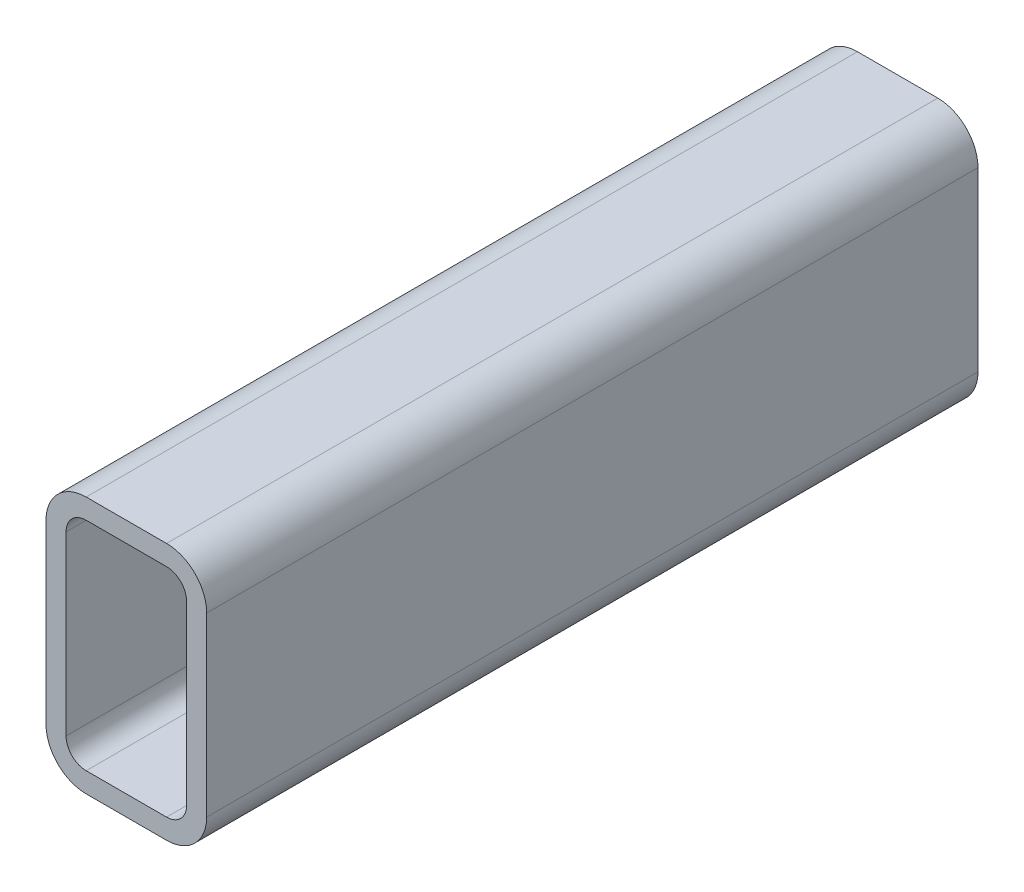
ISO-10303-21;
HEADER;
FILE_DESCRIPTION(('STEP AP214'),'2;1');
FILE_NAME('part.step','',(''),(''),'','','');
FILE_SCHEMA(('AUTOMOTIVE_DESIGN { 1 0 10303 214 1 1 1 1 }'));
ENDSEC;
DATA;
#1=APPLICATION_CONTEXT('core data for automotive mechanical design processes');
#2=APPLICATION_PROTOCOL_DEFINITION('international standard','automotive_design',2000,#1);
#3=PRODUCT_CONTEXT('',#1,'mechanical');
#4=PRODUCT('Part','Part','',(#3));
#5=PRODUCT_RELATED_PRODUCT_CATEGORY('part','',(#4));
#6=PRODUCT_DEFINITION_FORMATION('','',#4);
#7=PRODUCT_DEFINITION_CONTEXT('part definition',#1,'design');
#8=PRODUCT_DEFINITION('design','',#6,#7);
#9=PRODUCT_DEFINITION_SHAPE('','',#8);
#10=(LENGTH_UNIT() NAMED_UNIT(*) SI_UNIT(.MILLI.,.METRE.));
#11=(NAMED_UNIT(*) PLANE_ANGLE_UNIT() SI_UNIT($,.RADIAN.));
#12=(NAMED_UNIT(*) SI_UNIT($,.STERADIAN.) SOLID_ANGLE_UNIT());
#13=UNCERTAINTY_MEASURE_WITH_UNIT(LENGTH_MEASURE(1.E-05),#10,'distance_accuracy_value','');
#14=(GEOMETRIC_REPRESENTATION_CONTEXT(3) GLOBAL_UNCERTAINTY_ASSIGNED_CONTEXT((#13)) GLOBAL_UNIT_ASSIGNED_CONTEXT((#10,
#11,#12)) REPRESENTATION_CONTEXT('',''));
#15=CARTESIAN_POINT('',(0.,0.,0.));
#16=DIRECTION('',(0.,0.,1.));
#17=DIRECTION('',(1.,0.,0.));
#18=AXIS2_PLACEMENT_3D('',#15,#16,#17);
#19=CARTESIAN_POINT('',(18.7710851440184,87.7827651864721,304.8));
#20=DIRECTION('',(0.,0.,1.));
#21=DIRECTION('',(1.,0.,0.));
#22=AXIS2_PLACEMENT_3D('',#19,#20,#21);
#23=PLANE('',#22);
#24=CARTESIAN_POINT('',(18.7710851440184,87.7827651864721,304.8));
#25=DIRECTION('',(0.,0.,1.));
#26=DIRECTION('',(1.,0.,0.));
#27=AXIS2_PLACEMENT_3D('',#24,#25,#26);
#28=CIRCLE('',#27,15.875);
#29=CARTESIAN_POINT('',(18.7710851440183,103.657765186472,304.8));
#30=VERTEX_POINT('',#29);
#31=CARTESIAN_POINT('',(2.89608514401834,87.7827651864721,304.8));
#32=VERTEX_POINT('',#31);
#33=EDGE_CURVE('E211',#30,#32,#28,.T.);
#34=ORIENTED_EDGE('',*,*,#33,.T.);
#35=DIRECTION('',(0.,-1.,0.));
#36=VECTOR('',#35,1.);
#37=CARTESIAN_POINT('',(2.89608514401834,17.9327651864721,304.8));
#38=LINE('',#37,#36);
#39=CARTESIAN_POINT('',(2.89608514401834,17.9327651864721,304.8));
#40=VERTEX_POINT('',#39);
#41=EDGE_CURVE('E214',#32,#40,#38,.T.);
#42=ORIENTED_EDGE('',*,*,#41,.T.);
#43=CARTESIAN_POINT('',(18.7710851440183,17.9327651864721,304.8));
#44=DIRECTION('',(0.,0.,1.));
#45=DIRECTION('',(1.,0.,0.));
#46=AXIS2_PLACEMENT_3D('',#43,#44,#45);
#47=CIRCLE('',#46,15.875);
#48=CARTESIAN_POINT('',(18.7710851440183,2.05776518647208,304.8));
#49=VERTEX_POINT('',#48);
#50=EDGE_CURVE('E217',#40,#49,#47,.T.);
#51=ORIENTED_EDGE('',*,*,#50,.T.);
#52=DIRECTION('',(1.,0.,0.));
#53=VECTOR('',#52,1.);
#54=CARTESIAN_POINT('',(50.5210851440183,2.05776518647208,304.8));
#55=LINE('',#54,#53);
#56=CARTESIAN_POINT('',(50.5210851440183,2.05776518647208,304.8));
#57=VERTEX_POINT('',#56);
#58=EDGE_CURVE('E219',#49,#57,#55,.T.);
#59=ORIENTED_EDGE('',*,*,#58,.T.);
#60=CARTESIAN_POINT('',(50.5210851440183,17.9327651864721,304.8));
#61=DIRECTION('',(0.,0.,1.));
#62=DIRECTION('',(1.,0.,0.));
#63=AXIS2_PLACEMENT_3D('',#60,#61,#62);
#64=CIRCLE('',#63,15.875);
#65=CARTESIAN_POINT('',(66.3960851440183,17.9327651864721,304.8));
#66=VERTEX_POINT('',#65);
#67=EDGE_CURVE('E221',#57,#66,#64,.T.);
#68=ORIENTED_EDGE('',*,*,#67,.T.);
#69=DIRECTION('',(0.,1.,0.));
#70=VECTOR('',#69,1.);
#71=CARTESIAN_POINT('',(66.3960851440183,87.7827651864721,304.8));
#72=LINE('',#71,#70);
#73=CARTESIAN_POINT('',(66.3960851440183,87.7827651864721,304.8));
#74=VERTEX_POINT('',#73);
#75=EDGE_CURVE('E223',#66,#74,#72,.T.);
#76=ORIENTED_EDGE('',*,*,#75,.T.);
#77=CARTESIAN_POINT('',(50.5210851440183,87.7827651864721,304.8));
#78=DIRECTION('',(0.,0.,1.));
#79=DIRECTION('',(1.,0.,0.));
#80=AXIS2_PLACEMENT_3D('',#77,#78,#79);
#81=CIRCLE('',#80,15.875);
#82=CARTESIAN_POINT('',(50.5210851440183,103.657765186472,304.8));
#83=VERTEX_POINT('',#82);
#84=EDGE_CURVE('E225',#74,#83,#81,.T.);
#85=ORIENTED_EDGE('',*,*,#84,.T.);
#86=DIRECTION('',(-1.,0.,0.));
#87=VECTOR('',#86,1.);
#88=CARTESIAN_POINT('',(18.7710851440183,103.657765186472,304.8));
#89=LINE('',#88,#87);
#90=EDGE_CURVE('E227',#83,#30,#89,.T.);
#91=ORIENTED_EDGE('',*,*,#90,.T.);
#92=EDGE_LOOP('',(#34,#42,#51,#59,#68,#76,#85,#91));
#93=FACE_BOUND('',#92,.T.);
#94=DIRECTION('',(0.,-1.,0.));
#95=VECTOR('',#94,1.);
#96=CARTESIAN_POINT('',(10.8335851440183,17.9327651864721,304.8));
#97=LINE('',#96,#95);
#98=CARTESIAN_POINT('',(10.8335851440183,87.7827651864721,304.8));
#99=VERTEX_POINT('',#98);
#100=CARTESIAN_POINT('',(10.8335851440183,17.9327651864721,304.8));
#101=VERTEX_POINT('',#100);
#102=EDGE_CURVE('E154',#99,#101,#97,.T.);
#103=ORIENTED_EDGE('',*,*,#102,.F.);
#104=CARTESIAN_POINT('',(18.7710851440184,87.7827651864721,304.8));
#105=DIRECTION('',(0.,0.,1.));
#106=DIRECTION('',(1.,0.,0.));
#107=AXIS2_PLACEMENT_3D('',#104,#105,#106);
#108=CIRCLE('',#107,7.9375);
#109=CARTESIAN_POINT('',(18.7710851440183,95.7202651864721,304.8));
#110=VERTEX_POINT('',#109);
#111=EDGE_CURVE('E146',#110,#99,#108,.T.);
#112=ORIENTED_EDGE('',*,*,#111,.F.);
#113=DIRECTION('',(-1.,0.,0.));
#114=VECTOR('',#113,1.);
#115=CARTESIAN_POINT('',(18.7710851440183,95.7202651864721,304.8));
#116=LINE('',#115,#114);
#117=CARTESIAN_POINT('',(50.5210851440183,95.7202651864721,304.8));
#118=VERTEX_POINT('',#117);
#119=EDGE_CURVE('E179',#118,#110,#116,.T.);
#120=ORIENTED_EDGE('',*,*,#119,.F.);
#121=CARTESIAN_POINT('',(50.5210851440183,87.7827651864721,304.8));
#122=DIRECTION('',(0.,0.,1.));
#123=DIRECTION('',(1.,0.,0.));
#124=AXIS2_PLACEMENT_3D('',#121,#122,#123);
#125=CIRCLE('',#124,7.93750000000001);
#126=CARTESIAN_POINT('',(58.4585851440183,87.7827651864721,304.8));
#127=VERTEX_POINT('',#126);
#128=EDGE_CURVE('E177',#127,#118,#125,.T.);
#129=ORIENTED_EDGE('',*,*,#128,.F.);
#130=DIRECTION('',(0.,1.,0.));
#131=VECTOR('',#130,1.);
#132=CARTESIAN_POINT('',(58.4585851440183,87.7827651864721,304.8));
#133=LINE('',#132,#131);
#134=CARTESIAN_POINT('',(58.4585851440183,17.9327651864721,304.8));
#135=VERTEX_POINT('',#134);
#136=EDGE_CURVE('E175',#135,#127,#133,.T.);
#137=ORIENTED_EDGE('',*,*,#136,.F.);
#138=CARTESIAN_POINT('',(50.5210851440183,17.9327651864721,304.8));
#139=DIRECTION('',(0.,0.,1.));
#140=DIRECTION('',(1.,0.,0.));
#141=AXIS2_PLACEMENT_3D('',#138,#139,#140);
#142=CIRCLE('',#141,7.93750000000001);
#143=CARTESIAN_POINT('',(50.5210851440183,9.99526518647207,304.8));
#144=VERTEX_POINT('',#143);
#145=EDGE_CURVE('E173',#144,#135,#142,.T.);
#146=ORIENTED_EDGE('',*,*,#145,.F.);
#147=DIRECTION('',(1.,0.,0.));
#148=VECTOR('',#147,1.);
#149=CARTESIAN_POINT('',(50.5210851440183,9.99526518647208,304.8));
#150=LINE('',#149,#148);
#151=CARTESIAN_POINT('',(18.7710851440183,9.99526518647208,304.8));
#152=VERTEX_POINT('',#151);
#153=EDGE_CURVE('E169',#152,#144,#150,.T.);
#154=ORIENTED_EDGE('',*,*,#153,.F.);
#155=CARTESIAN_POINT('',(18.7710851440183,17.9327651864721,304.8));
#156=DIRECTION('',(0.,0.,1.));
#157=DIRECTION('',(1.,0.,0.));
#158=AXIS2_PLACEMENT_3D('',#155,#156,#157);
#159=CIRCLE('',#158,7.9375);
#160=EDGE_CURVE('E167',#101,#152,#159,.T.);
#161=ORIENTED_EDGE('',*,*,#160,.F.);
#162=EDGE_LOOP('',(#103,#112,#120,#129,#137,#146,#154,#161));
#163=FACE_BOUND('',#162,.T.);
#164=ADVANCED_FACE('F33',(#93,#163),#23,.T.);
#165=CARTESIAN_POINT('',(18.7710851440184,87.7827651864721,0.));
#166=DIRECTION('',(0.,0.,1.));
#167=DIRECTION('',(1.,0.,0.));
#168=AXIS2_PLACEMENT_3D('',#165,#166,#167);
#169=PLANE('',#168);
#170=CARTESIAN_POINT('',(18.7710851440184,87.7827651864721,0.));
#171=DIRECTION('',(0.,0.,1.));
#172=DIRECTION('',(1.,0.,0.));
#173=AXIS2_PLACEMENT_3D('',#170,#171,#172);
#174=CIRCLE('',#173,15.875);
#175=CARTESIAN_POINT('',(18.7710851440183,103.657765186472,0.));
#176=VERTEX_POINT('',#175);
#177=CARTESIAN_POINT('',(2.89608514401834,87.7827651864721,0.));
#178=VERTEX_POINT('',#177);
#179=EDGE_CURVE('E162',#176,#178,#174,.T.);
#180=ORIENTED_EDGE('',*,*,#179,.F.);
#181=DIRECTION('',(-1.,0.,0.));
#182=VECTOR('',#181,1.);
#183=CARTESIAN_POINT('',(18.7710851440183,103.657765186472,0.));
#184=LINE('',#183,#182);
#185=CARTESIAN_POINT('',(50.5210851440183,103.657765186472,0.));
#186=VERTEX_POINT('',#185);
#187=EDGE_CURVE('E215',#186,#176,#184,.T.);
#188=ORIENTED_EDGE('',*,*,#187,.F.);
#189=CARTESIAN_POINT('',(50.5210851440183,87.7827651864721,0.));
#190=DIRECTION('',(0.,0.,1.));
#191=DIRECTION('',(1.,0.,0.));
#192=AXIS2_PLACEMENT_3D('',#189,#190,#191);
#193=CIRCLE('',#192,15.875);
#194=CARTESIAN_POINT('',(66.3960851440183,87.7827651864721,0.));
#195=VERTEX_POINT('',#194);
#196=EDGE_CURVE('E242',#195,#186,#193,.T.);
#197=ORIENTED_EDGE('',*,*,#196,.F.);
#198=DIRECTION('',(0.,1.,0.));
#199=VECTOR('',#198,1.);
#200=CARTESIAN_POINT('',(66.3960851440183,87.7827651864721,0.));
#201=LINE('',#200,#199);
#202=CARTESIAN_POINT('',(66.3960851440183,17.9327651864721,0.));
#203=VERTEX_POINT('',#202);
#204=EDGE_CURVE('E240',#203,#195,#201,.T.);
#205=ORIENTED_EDGE('',*,*,#204,.F.);
#206=CARTESIAN_POINT('',(50.5210851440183,17.9327651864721,0.));
#207=DIRECTION('',(0.,0.,1.));
#208=DIRECTION('',(1.,0.,0.));
#209=AXIS2_PLACEMENT_3D('',#206,#207,#208);
#210=CIRCLE('',#209,15.875);
#211=CARTESIAN_POINT('',(50.5210851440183,2.05776518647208,0.));
#212=VERTEX_POINT('',#211);
#213=EDGE_CURVE('E238',#212,#203,#210,.T.);
#214=ORIENTED_EDGE('',*,*,#213,.F.);
#215=DIRECTION('',(1.,0.,0.));
#216=VECTOR('',#215,1.);
#217=CARTESIAN_POINT('',(50.5210851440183,2.05776518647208,0.));
#218=LINE('',#217,#216);
#219=CARTESIAN_POINT('',(18.7710851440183,2.05776518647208,0.));
#220=VERTEX_POINT('',#219);
#221=EDGE_CURVE('E236',#220,#212,#218,.T.);
#222=ORIENTED_EDGE('',*,*,#221,.F.);
#223=CARTESIAN_POINT('',(18.7710851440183,17.9327651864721,0.));
#224=DIRECTION('',(0.,0.,1.));
#225=DIRECTION('',(1.,0.,0.));
#226=AXIS2_PLACEMENT_3D('',#223,#224,#225);
#227=CIRCLE('',#226,15.875);
#228=CARTESIAN_POINT('',(2.89608514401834,17.9327651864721,0.));
#229=VERTEX_POINT('',#228);
#230=EDGE_CURVE('E234',#229,#220,#227,.T.);
#231=ORIENTED_EDGE('',*,*,#230,.F.);
#232=DIRECTION('',(0.,-1.,0.));
#233=VECTOR('',#232,1.);
#234=CARTESIAN_POINT('',(2.89608514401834,17.9327651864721,0.));
#235=LINE('',#234,#233);
#236=EDGE_CURVE('E232',#178,#229,#235,.T.);
#237=ORIENTED_EDGE('',*,*,#236,.F.);
#238=EDGE_LOOP('',(#180,#188,#197,#205,#214,#222,#231,#237));
#239=FACE_BOUND('',#238,.T.);
#240=CARTESIAN_POINT('',(18.7710851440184,87.7827651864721,0.));
#241=DIRECTION('',(0.,0.,1.));
#242=DIRECTION('',(1.,0.,0.));
#243=AXIS2_PLACEMENT_3D('',#240,#241,#242);
#244=CIRCLE('',#243,7.9375);
#245=CARTESIAN_POINT('',(18.7710851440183,95.7202651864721,0.));
#246=VERTEX_POINT('',#245);
#247=CARTESIAN_POINT('',(10.8335851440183,87.7827651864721,0.));
#248=VERTEX_POINT('',#247);
#249=EDGE_CURVE('E56',#246,#248,#244,.T.);
#250=ORIENTED_EDGE('',*,*,#249,.T.);
#251=DIRECTION('',(0.,-1.,0.));
#252=VECTOR('',#251,1.);
#253=CARTESIAN_POINT('',(10.8335851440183,17.9327651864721,0.));
#254=LINE('',#253,#252);
#255=CARTESIAN_POINT('',(10.8335851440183,17.9327651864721,0.));
#256=VERTEX_POINT('',#255);
#257=EDGE_CURVE('E161',#248,#256,#254,.T.);
#258=ORIENTED_EDGE('',*,*,#257,.T.);
#259=CARTESIAN_POINT('',(18.7710851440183,17.9327651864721,0.));
#260=DIRECTION('',(0.,0.,1.));
#261=DIRECTION('',(1.,0.,0.));
#262=AXIS2_PLACEMENT_3D('',#259,#260,#261);
#263=CIRCLE('',#262,7.9375);
#264=CARTESIAN_POINT('',(18.7710851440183,9.99526518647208,0.));
#265=VERTEX_POINT('',#264);
#266=EDGE_CURVE('E183',#256,#265,#263,.T.);
#267=ORIENTED_EDGE('',*,*,#266,.T.);
#268=DIRECTION('',(1.,0.,0.));
#269=VECTOR('',#268,1.);
#270=CARTESIAN_POINT('',(50.5210851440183,9.99526518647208,0.));
#271=LINE('',#270,#269);
#272=CARTESIAN_POINT('',(50.5210851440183,9.99526518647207,0.));
#273=VERTEX_POINT('',#272);
#274=EDGE_CURVE('E186',#265,#273,#271,.T.);
#275=ORIENTED_EDGE('',*,*,#274,.T.);
#276=CARTESIAN_POINT('',(50.5210851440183,17.9327651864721,0.));
#277=DIRECTION('',(0.,0.,1.));
#278=DIRECTION('',(1.,0.,0.));
#279=AXIS2_PLACEMENT_3D('',#276,#277,#278);
#280=CIRCLE('',#279,7.93750000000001);
#281=CARTESIAN_POINT('',(58.4585851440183,17.9327651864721,0.));
#282=VERTEX_POINT('',#281);
#283=EDGE_CURVE('E189',#273,#282,#280,.T.);
#284=ORIENTED_EDGE('',*,*,#283,.T.);
#285=DIRECTION('',(0.,1.,0.));
#286=VECTOR('',#285,1.);
#287=CARTESIAN_POINT('',(58.4585851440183,87.7827651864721,0.));
#288=LINE('',#287,#286);
#289=CARTESIAN_POINT('',(58.4585851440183,87.7827651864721,0.));
#290=VERTEX_POINT('',#289);
#291=EDGE_CURVE('E192',#282,#290,#288,.T.);
#292=ORIENTED_EDGE('',*,*,#291,.T.);
#293=CARTESIAN_POINT('',(50.5210851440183,87.7827651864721,0.));
#294=DIRECTION('',(0.,0.,1.));
#295=DIRECTION('',(1.,0.,0.));
#296=AXIS2_PLACEMENT_3D('',#293,#294,#295);
#297=CIRCLE('',#296,7.93750000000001);
#298=CARTESIAN_POINT('',(50.5210851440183,95.7202651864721,0.));
#299=VERTEX_POINT('',#298);
#300=EDGE_CURVE('E195',#290,#299,#297,.T.);
#301=ORIENTED_EDGE('',*,*,#300,.T.);
#302=DIRECTION('',(-1.,0.,0.));
#303=VECTOR('',#302,1.);
#304=CARTESIAN_POINT('',(18.7710851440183,95.7202651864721,0.));
#305=LINE('',#304,#303);
#306=EDGE_CURVE('E155',#299,#246,#305,.T.);
#307=ORIENTED_EDGE('',*,*,#306,.T.);
#308=EDGE_LOOP('',(#250,#258,#267,#275,#284,#292,#301,#307));
#309=FACE_BOUND('',#308,.T.);
#310=ADVANCED_FACE('F272',(#239,#309),#169,.F.);
#311=CARTESIAN_POINT('',(18.7710851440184,87.7827651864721,304.8));
#312=DIRECTION('',(0.,0.,-1.));
#313=DIRECTION('',(-1.,0.,0.));
#314=AXIS2_PLACEMENT_3D('',#311,#312,#313);
#315=CYLINDRICAL_SURFACE('',#314,15.875);
#316=ORIENTED_EDGE('',*,*,#179,.T.);
#317=DIRECTION('',(0.,0.,-1.));
#318=VECTOR('',#317,1.);
#319=CARTESIAN_POINT('',(2.89608514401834,87.7827651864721,304.8));
#320=LINE('',#319,#318);
#321=EDGE_CURVE('E11',#32,#178,#320,.T.);
#322=ORIENTED_EDGE('',*,*,#321,.F.);
#323=ORIENTED_EDGE('',*,*,#33,.F.);
#324=DIRECTION('',(0.,0.,-1.));
#325=VECTOR('',#324,1.);
#326=CARTESIAN_POINT('',(18.7710851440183,103.657765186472,304.8));
#327=LINE('',#326,#325);
#328=EDGE_CURVE('E229',#30,#176,#327,.T.);
#329=ORIENTED_EDGE('',*,*,#328,.T.);
#330=EDGE_LOOP('',(#316,#322,#323,#329));
#331=FACE_BOUND('',#330,.T.);
#332=ADVANCED_FACE('F35',(#331),#315,.T.);
#333=CARTESIAN_POINT('',(2.89608514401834,17.9327651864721,304.8));
#334=DIRECTION('',(1.,0.,0.));
#335=DIRECTION('',(0.,0.,-1.));
#336=AXIS2_PLACEMENT_3D('',#333,#334,#335);
#337=PLANE('',#336);
#338=ORIENTED_EDGE('',*,*,#236,.T.);
#339=DIRECTION('',(0.,0.,-1.));
#340=VECTOR('',#339,1.);
#341=CARTESIAN_POINT('',(2.89608514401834,17.9327651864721,304.8));
#342=LINE('',#341,#340);
#343=EDGE_CURVE('E41',#40,#229,#342,.T.);
#344=ORIENTED_EDGE('',*,*,#343,.F.);
#345=ORIENTED_EDGE('',*,*,#41,.F.);
#346=ORIENTED_EDGE('',*,*,#321,.T.);
#347=EDGE_LOOP('',(#338,#344,#345,#346));
#348=FACE_BOUND('',#347,.T.);
#349=ADVANCED_FACE('F289',(#348),#337,.F.);
#350=CARTESIAN_POINT('',(18.7710851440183,17.9327651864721,304.8));
#351=DIRECTION('',(0.,0.,-1.));
#352=DIRECTION('',(-1.,0.,0.));
#353=AXIS2_PLACEMENT_3D('',#350,#351,#352);
#354=CYLINDRICAL_SURFACE('',#353,15.875);
#355=ORIENTED_EDGE('',*,*,#230,.T.);
#356=DIRECTION('',(0.,0.,-1.));
#357=VECTOR('',#356,1.);
#358=CARTESIAN_POINT('',(18.7710851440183,2.05776518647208,304.8));
#359=LINE('',#358,#357);
#360=EDGE_CURVE('E259',#49,#220,#359,.T.);
#361=ORIENTED_EDGE('',*,*,#360,.F.);
#362=ORIENTED_EDGE('',*,*,#50,.F.);
#363=ORIENTED_EDGE('',*,*,#343,.T.);
#364=EDGE_LOOP('',(#355,#361,#362,#363));
#365=FACE_BOUND('',#364,.T.);
#366=ADVANCED_FACE('F266',(#365),#354,.T.);
#367=CARTESIAN_POINT('',(50.5210851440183,2.05776518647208,304.8));
#368=DIRECTION('',(0.,1.,0.));
#369=DIRECTION('',(0.,0.,1.));
#370=AXIS2_PLACEMENT_3D('',#367,#368,#369);
#371=PLANE('',#370);
#372=ORIENTED_EDGE('',*,*,#221,.T.);
#373=DIRECTION('',(0.,0.,-1.));
#374=VECTOR('',#373,1.);
#375=CARTESIAN_POINT('',(50.5210851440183,2.05776518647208,304.8));
#376=LINE('',#375,#374);
#377=EDGE_CURVE('E256',#57,#212,#376,.T.);
#378=ORIENTED_EDGE('',*,*,#377,.F.);
#379=ORIENTED_EDGE('',*,*,#58,.F.);
#380=ORIENTED_EDGE('',*,*,#360,.T.);
#381=EDGE_LOOP('',(#372,#378,#379,#380));
#382=FACE_BOUND('',#381,.T.);
#383=ADVANCED_FACE('F278',(#382),#371,.F.);
#384=CARTESIAN_POINT('',(50.5210851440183,17.9327651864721,304.8));
#385=DIRECTION('',(0.,0.,-1.));
#386=DIRECTION('',(-1.,0.,0.));
#387=AXIS2_PLACEMENT_3D('',#384,#385,#386);
#388=CYLINDRICAL_SURFACE('',#387,15.875);
#389=ORIENTED_EDGE('',*,*,#213,.T.);
#390=DIRECTION('',(0.,0.,-1.));
#391=VECTOR('',#390,1.);
#392=CARTESIAN_POINT('',(66.3960851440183,17.9327651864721,304.8));
#393=LINE('',#392,#391);
#394=EDGE_CURVE('E253',#66,#203,#393,.T.);
#395=ORIENTED_EDGE('',*,*,#394,.F.);
#396=ORIENTED_EDGE('',*,*,#67,.F.);
#397=ORIENTED_EDGE('',*,*,#377,.T.);
#398=EDGE_LOOP('',(#389,#395,#396,#397));
#399=FACE_BOUND('',#398,.T.);
#400=ADVANCED_FACE('F282',(#399),#388,.T.);
#401=CARTESIAN_POINT('',(66.3960851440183,87.7827651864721,304.8));
#402=DIRECTION('',(-1.,0.,0.));
#403=DIRECTION('',(0.,0.,1.));
#404=AXIS2_PLACEMENT_3D('',#401,#402,#403);
#405=PLANE('',#404);
#406=ORIENTED_EDGE('',*,*,#204,.T.);
#407=DIRECTION('',(0.,0.,-1.));
#408=VECTOR('',#407,1.);
#409=CARTESIAN_POINT('',(66.3960851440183,87.7827651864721,304.8));
#410=LINE('',#409,#408);
#411=EDGE_CURVE('E250',#74,#195,#410,.T.);
#412=ORIENTED_EDGE('',*,*,#411,.F.);
#413=ORIENTED_EDGE('',*,*,#75,.F.);
#414=ORIENTED_EDGE('',*,*,#394,.T.);
#415=EDGE_LOOP('',(#406,#412,#413,#414));
#416=FACE_BOUND('',#415,.T.);
#417=ADVANCED_FACE('F302',(#416),#405,.F.);
#418=CARTESIAN_POINT('',(50.5210851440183,87.7827651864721,304.8));
#419=DIRECTION('',(0.,0.,-1.));
#420=DIRECTION('',(-1.,0.,0.));
#421=AXIS2_PLACEMENT_3D('',#418,#419,#420);
#422=CYLINDRICAL_SURFACE('',#421,15.875);
#423=ORIENTED_EDGE('',*,*,#196,.T.);
#424=DIRECTION('',(0.,0.,-1.));
#425=VECTOR('',#424,1.);
#426=CARTESIAN_POINT('',(50.5210851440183,103.657765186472,304.8));
#427=LINE('',#426,#425);
#428=EDGE_CURVE('E247',#83,#186,#427,.T.);
#429=ORIENTED_EDGE('',*,*,#428,.F.);
#430=ORIENTED_EDGE('',*,*,#84,.F.);
#431=ORIENTED_EDGE('',*,*,#411,.T.);
#432=EDGE_LOOP('',(#423,#429,#430,#431));
#433=FACE_BOUND('',#432,.T.);
#434=ADVANCED_FACE('F300',(#433),#422,.T.);
#435=CARTESIAN_POINT('',(18.7710851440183,103.657765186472,304.8));
#436=DIRECTION('',(0.,-1.,0.));
#437=DIRECTION('',(0.,0.,-1.));
#438=AXIS2_PLACEMENT_3D('',#435,#436,#437);
#439=PLANE('',#438);
#440=ORIENTED_EDGE('',*,*,#187,.T.);
#441=ORIENTED_EDGE('',*,*,#328,.F.);
#442=ORIENTED_EDGE('',*,*,#90,.F.);
#443=ORIENTED_EDGE('',*,*,#428,.T.);
#444=EDGE_LOOP('',(#440,#441,#442,#443));
#445=FACE_BOUND('',#444,.T.);
#446=ADVANCED_FACE('F295',(#445),#439,.F.);
#447=CARTESIAN_POINT('',(18.7710851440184,87.7827651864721,304.8));
#448=DIRECTION('',(0.,0.,-1.));
#449=DIRECTION('',(-1.,0.,0.));
#450=AXIS2_PLACEMENT_3D('',#447,#448,#449);
#451=CYLINDRICAL_SURFACE('',#450,7.9375);
#452=ORIENTED_EDGE('',*,*,#249,.F.);
#453=DIRECTION('',(0.,0.,-1.));
#454=VECTOR('',#453,1.);
#455=CARTESIAN_POINT('',(18.7710851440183,95.7202651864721,304.8));
#456=LINE('',#455,#454);
#457=EDGE_CURVE('E150',#110,#246,#456,.T.);
#458=ORIENTED_EDGE('',*,*,#457,.F.);
#459=ORIENTED_EDGE('',*,*,#111,.T.);
#460=DIRECTION('',(0.,0.,-1.));
#461=VECTOR('',#460,1.);
#462=CARTESIAN_POINT('',(10.8335851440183,87.7827651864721,304.8));
#463=LINE('',#462,#461);
#464=EDGE_CURVE('E149',#99,#248,#463,.T.);
#465=ORIENTED_EDGE('',*,*,#464,.T.);
#466=EDGE_LOOP('',(#452,#458,#459,#465));
#467=FACE_BOUND('',#466,.T.);
#468=ADVANCED_FACE('F148',(#467),#451,.F.);
#469=CARTESIAN_POINT('',(10.8335851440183,17.9327651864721,304.8));
#470=DIRECTION('',(1.,0.,0.));
#471=DIRECTION('',(0.,0.,-1.));
#472=AXIS2_PLACEMENT_3D('',#469,#470,#471);
#473=PLANE('',#472);
#474=ORIENTED_EDGE('',*,*,#257,.F.);
#475=ORIENTED_EDGE('',*,*,#464,.F.);
#476=ORIENTED_EDGE('',*,*,#102,.T.);
#477=DIRECTION('',(0.,0.,-1.));
#478=VECTOR('',#477,1.);
#479=CARTESIAN_POINT('',(10.8335851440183,17.9327651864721,304.8));
#480=LINE('',#479,#478);
#481=EDGE_CURVE('E163',#101,#256,#480,.T.);
#482=ORIENTED_EDGE('',*,*,#481,.T.);
#483=EDGE_LOOP('',(#474,#475,#476,#482));
#484=FACE_BOUND('',#483,.T.);
#485=ADVANCED_FACE('F158',(#484),#473,.T.);
#486=CARTESIAN_POINT('',(18.7710851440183,17.9327651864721,304.8));
#487=DIRECTION('',(0.,0.,-1.));
#488=DIRECTION('',(-1.,0.,0.));
#489=AXIS2_PLACEMENT_3D('',#486,#487,#488);
#490=CYLINDRICAL_SURFACE('',#489,7.9375);
#491=ORIENTED_EDGE('',*,*,#266,.F.);
#492=ORIENTED_EDGE('',*,*,#481,.F.);
#493=ORIENTED_EDGE('',*,*,#160,.T.);
#494=DIRECTION('',(0.,0.,-1.));
#495=VECTOR('',#494,1.);
#496=CARTESIAN_POINT('',(18.7710851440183,9.99526518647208,304.8));
#497=LINE('',#496,#495);
#498=EDGE_CURVE('E208',#152,#265,#497,.T.);
#499=ORIENTED_EDGE('',*,*,#498,.T.);
#500=EDGE_LOOP('',(#491,#492,#493,#499));
#501=FACE_BOUND('',#500,.T.);
#502=ADVANCED_FACE('F327',(#501),#490,.F.);
#503=CARTESIAN_POINT('',(50.5210851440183,9.99526518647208,304.8));
#504=DIRECTION('',(0.,1.,0.));
#505=DIRECTION('',(0.,0.,1.));
#506=AXIS2_PLACEMENT_3D('',#503,#504,#505);
#507=PLANE('',#506);
#508=ORIENTED_EDGE('',*,*,#274,.F.);
#509=ORIENTED_EDGE('',*,*,#498,.F.);
#510=ORIENTED_EDGE('',*,*,#153,.T.);
#511=DIRECTION('',(0.,0.,-1.));
#512=VECTOR('',#511,1.);
#513=CARTESIAN_POINT('',(50.5210851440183,9.99526518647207,304.8));
#514=LINE('',#513,#512);
#515=EDGE_CURVE('E206',#144,#273,#514,.T.);
#516=ORIENTED_EDGE('',*,*,#515,.T.);
#517=EDGE_LOOP('',(#508,#509,#510,#516));
#518=FACE_BOUND('',#517,.T.);
#519=ADVANCED_FACE('F331',(#518),#507,.T.);
#520=CARTESIAN_POINT('',(50.5210851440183,17.9327651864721,304.8));
#521=DIRECTION('',(0.,0.,-1.));
#522=DIRECTION('',(-1.,0.,0.));
#523=AXIS2_PLACEMENT_3D('',#520,#521,#522);
#524=CYLINDRICAL_SURFACE('',#523,7.93750000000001);
#525=ORIENTED_EDGE('',*,*,#283,.F.);
#526=ORIENTED_EDGE('',*,*,#515,.F.);
#527=ORIENTED_EDGE('',*,*,#145,.T.);
#528=DIRECTION('',(0.,0.,-1.));
#529=VECTOR('',#528,1.);
#530=CARTESIAN_POINT('',(58.4585851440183,17.9327651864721,304.8));
#531=LINE('',#530,#529);
#532=EDGE_CURVE('E204',#135,#282,#531,.T.);
#533=ORIENTED_EDGE('',*,*,#532,.T.);
#534=EDGE_LOOP('',(#525,#526,#527,#533));
#535=FACE_BOUND('',#534,.T.);
#536=ADVANCED_FACE('F337',(#535),#524,.F.);
#537=CARTESIAN_POINT('',(58.4585851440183,87.7827651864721,304.8));
#538=DIRECTION('',(-1.,0.,0.));
#539=DIRECTION('',(0.,0.,1.));
#540=AXIS2_PLACEMENT_3D('',#537,#538,#539);
#541=PLANE('',#540);
#542=ORIENTED_EDGE('',*,*,#291,.F.);
#543=ORIENTED_EDGE('',*,*,#532,.F.);
#544=ORIENTED_EDGE('',*,*,#136,.T.);
#545=DIRECTION('',(0.,0.,-1.));
#546=VECTOR('',#545,1.);
#547=CARTESIAN_POINT('',(58.4585851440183,87.7827651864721,304.8));
#548=LINE('',#547,#546);
#549=EDGE_CURVE('E202',#127,#290,#548,.T.);
#550=ORIENTED_EDGE('',*,*,#549,.T.);
#551=EDGE_LOOP('',(#542,#543,#544,#550));
#552=FACE_BOUND('',#551,.T.);
#553=ADVANCED_FACE('F341',(#552),#541,.T.);
#554=CARTESIAN_POINT('',(50.5210851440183,87.7827651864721,304.8));
#555=DIRECTION('',(0.,0.,-1.));
#556=DIRECTION('',(-1.,0.,0.));
#557=AXIS2_PLACEMENT_3D('',#554,#555,#556);
#558=CYLINDRICAL_SURFACE('',#557,7.93750000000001);
#559=ORIENTED_EDGE('',*,*,#300,.F.);
#560=ORIENTED_EDGE('',*,*,#549,.F.);
#561=ORIENTED_EDGE('',*,*,#128,.T.);
#562=DIRECTION('',(0.,0.,-1.));
#563=VECTOR('',#562,1.);
#564=CARTESIAN_POINT('',(50.5210851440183,95.7202651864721,304.8));
#565=LINE('',#564,#563);
#566=EDGE_CURVE('E48',#118,#299,#565,.T.);
#567=ORIENTED_EDGE('',*,*,#566,.T.);
#568=EDGE_LOOP('',(#559,#560,#561,#567));
#569=FACE_BOUND('',#568,.T.);
#570=ADVANCED_FACE('F345',(#569),#558,.F.);
#571=CARTESIAN_POINT('',(18.7710851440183,95.7202651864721,304.8));
#572=DIRECTION('',(0.,-1.,0.));
#573=DIRECTION('',(0.,0.,-1.));
#574=AXIS2_PLACEMENT_3D('',#571,#572,#573);
#575=PLANE('',#574);
#576=ORIENTED_EDGE('',*,*,#306,.F.);
#577=ORIENTED_EDGE('',*,*,#566,.F.);
#578=ORIENTED_EDGE('',*,*,#119,.T.);
#579=ORIENTED_EDGE('',*,*,#457,.T.);
#580=EDGE_LOOP('',(#576,#577,#578,#579));
#581=FACE_BOUND('',#580,.T.);
#582=ADVANCED_FACE('F349',(#581),#575,.T.);
#583=CLOSED_SHELL('',(#164,#310,#332,#349,#366,#383,#400,#417,#434,#446,#468,#485,#502,#519,
#536,#553,#570,#582));
#584=MANIFOLD_SOLID_BREP('B2',#583);
#585=ADVANCED_BREP_SHAPE_REPRESENTATION('',(#18,#584),#14);
#586=SHAPE_DEFINITION_REPRESENTATION(#9,#585);
ENDSEC;
END-ISO-10303-21;
